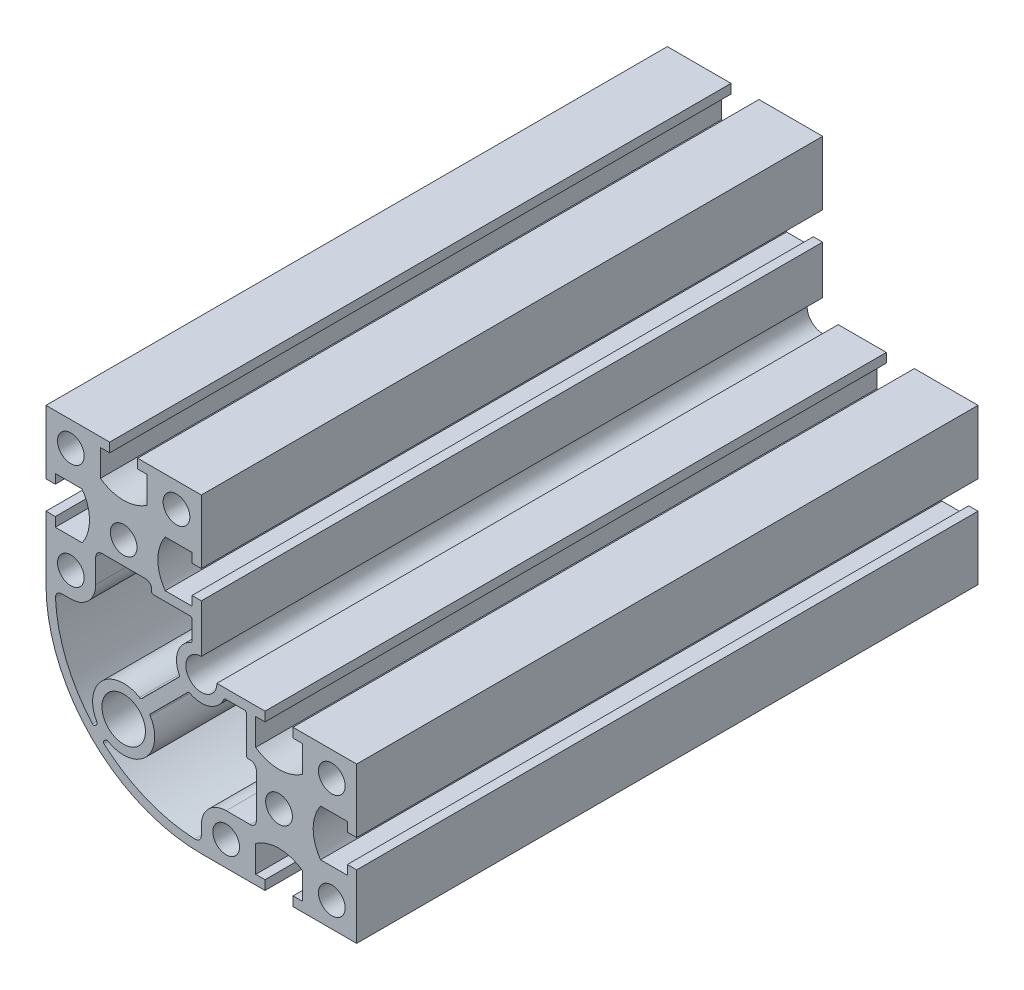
from build123d import *

# Parameters (mm, degrees)
SKETCH_1_R          = 2.15
EXTRUDE_1_DEPTH     = 50
SKETCH_2_R          = 3.5
CUT_EXTRUDE_1_DEPTH = 123.474487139


with BuildPart() as part:
    # Sketch 1 → Extrude 1 (new, symmetric)
    with BuildSketch(Plane.XY):
        with BuildLine():
            Line((0, 50), (0, 39.75))
            Line((0, 39.75), (1.5, 39.75))
            Line((1.5, 39.75), (1.5, 41.25))
            Line((1.5, 41.25), (5.809190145, 41.25))
            ThreePointArc((5.809190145, 41.25), (7, 37.5), (5.809190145, 33.75))
            Line((5.809190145, 33.75), (1.5, 33.75))
            Line((1.5, 33.75), (1.5, 35.25))
            Line((1.5, 35.25), (0, 35.25))
            Line((0, 35.25), (0, 25))
            ThreePointArc((0, 25), (7.32233047, 7.32233047), (25, 0))
            Line((25, 0), (35.25, 0))
            Line((35.25, 0), (35.25, 1.5))
            Line((35.25, 1.5), (33.75, 1.5))
            Line((33.75, 1.5), (33.75, 5.809190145))
            ThreePointArc((33.75, 5.809190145), (37.5, 7), (41.25, 5.809190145))
            Line((41.25, 5.809190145), (41.25, 1.5))
            Line((41.25, 1.5), (39.75, 1.5))
            Line((39.75, 1.5), (39.75, 0))
            Line((39.75, 0), (50, 0))
            Line((50, 0), (50, 10.25))
            Line((50, 10.25), (48.5, 10.25))
            Line((48.5, 10.25), (48.5, 8.75))
            Line((48.5, 8.75), (44.190809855, 8.75))
            ThreePointArc((44.190809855, 8.75), (43, 12.5), (44.190809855, 16.25))
            Line((44.190809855, 16.25), (48.5, 16.25))
            Line((48.5, 16.25), (48.5, 14.75))
            Line((48.5, 14.75), (50, 14.75))
            Line((50, 14.75), (50, 25))
            Line((50, 25), (39.75, 25))
            Line((39.75, 25), (39.75, 23.5))
            Line((39.75, 23.5), (41.25, 23.5))
            Line((41.25, 23.5), (41.25, 19.190809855))
            ThreePointArc((41.25, 19.190809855), (37.5, 18), (33.75, 19.190809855))
            Line((33.75, 19.190809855), (33.75, 23.5))
            Line((33.75, 23.5), (35.25, 23.5))
            Line((35.25, 23.5), (35.25, 25))
            Line((35.25, 25), (27.5, 25))
            ThreePointArc((27.5, 25), (23.232233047, 23.232233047), (25, 27.5))
            Line((25, 27.5), (25, 35.25))
            Line((25, 35.25), (23.5, 35.25))
            Line((23.5, 35.25), (23.5, 33.75))
            Line((23.5, 33.75), (19.190809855, 33.75))
            ThreePointArc((19.190809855, 33.75), (18, 37.5), (19.190809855, 41.25))
            Line((19.190809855, 41.25), (23.5, 41.25))
            Line((23.5, 41.25), (23.5, 39.75))
            Line((23.5, 39.75), (25, 39.75))
            Line((25, 39.75), (25, 50))
            Line((25, 50), (14.75, 50))
            Line((14.75, 50), (14.75, 48.5))
            Line((14.75, 48.5), (16.25, 48.5))
            Line((16.25, 48.5), (16.25, 44.190809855))
            ThreePointArc((16.25, 44.190809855), (12.5, 43), (8.75, 44.190809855))
            Line((8.75, 44.190809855), (8.75, 48.5))
            Line((8.75, 48.5), (10.25, 48.5))
            Line((10.25, 48.5), (10.25, 50))
            Line((10.25, 50), (0, 50))
        make_face()
        with Locations((46, 21)):
            Circle(SKETCH_1_R, mode=Mode.SUBTRACT)
        with Locations((46, 4)):
            Circle(SKETCH_1_R, mode=Mode.SUBTRACT)
        with Locations((29, 4)):
            Circle(SKETCH_1_R, mode=Mode.SUBTRACT)
        with Locations(Location((21, 46, 0), (0, 0, 180))):
            Circle(SKETCH_1_R, mode=Mode.SUBTRACT)
        with Locations(Location((4, 46, 0), (0, 0, 180))):
            Circle(SKETCH_1_R, mode=Mode.SUBTRACT)
        with Locations(Location((4, 29, 0), (0, 0, 180))):
            Circle(SKETCH_1_R, mode=Mode.SUBTRACT)
        with Locations((37.5, 12.5)):
            Circle(SKETCH_1_R, mode=Mode.SUBTRACT)
        with Locations((12.5, 37.5)):
            Circle(SKETCH_1_R, mode=Mode.SUBTRACT)
    extrude(amount=EXTRUDE_1_DEPTH, both=True)

    # Sketch 2 → Cut-Extrude 1 (cut, through all)
    with BuildSketch(Plane.XY.offset(50)):
        with Locations((12.5, 12.5)):
            Circle(SKETCH_2_R)
        with BuildLine():
            Line((8, 29), (8, 32.85))
            ThreePointArc((8, 32.85), (8.292893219, 33.557106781), (9, 33.85))
            Line((9, 33.85), (16, 33.85))
            ThreePointArc((16, 33.85), (16.707106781, 33.557106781), (17, 32.85))
            Line((17, 32.85), (17, 32.55))
            ThreePointArc((17, 32.55), (17.087867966, 32.337867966), (17.3, 32.25))
            Line((17.3, 32.25), (23.2, 32.25))
            ThreePointArc((23.2, 32.25), (23.412132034, 32.162132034), (23.5, 31.95))
            Line((23.5, 31.95), (23.5, 28.905124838))
            ThreePointArc((23.5, 28.905124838), (23.452660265, 28.743375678), (23.325581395, 28.632674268))
            ThreePointArc((23.325581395, 28.632674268), (21.216233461, 26.297347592), (21.448824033, 23.159035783))
            ThreePointArc((21.448824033, 23.159035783), (21.478955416, 22.975074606), (21.39461787, 22.808831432))
            Line((21.39461787, 22.808831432), (15.426073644, 16.840287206))
            ThreePointArc((15.426073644, 16.840287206), (15.251018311, 16.754719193), (15.060322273, 16.794735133))
            ThreePointArc((15.060322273, 16.794735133), (8.964466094, 16.035533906), (8.205264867, 9.939677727))
            ThreePointArc((8.205264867, 9.939677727), (8.245280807, 9.748981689), (8.159712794, 9.573926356))
            Line((8.159712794, 9.573926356), (7.913790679, 9.328004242))
            ThreePointArc((7.913790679, 9.328004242), (7.693250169, 9.240254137), (7.477973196, 9.340224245))
            ThreePointArc((7.477973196, 9.340224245), (3.237015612, 16.133066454), (1.52322135, 23.955555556))
            ThreePointArc((1.52322135, 23.955555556), (1.799583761, 24.691214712), (2.522233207, 25))
            Line((2.522233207, 25), (4, 25))
            ThreePointArc((4, 25), (6.828427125, 26.171572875), (8, 29))
        make_face()
        with BuildLine():
            Line((28.905124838, 23.5), (31.95, 23.5))
            ThreePointArc((31.95, 23.5), (32.162132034, 23.412132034), (32.25, 23.2))
            Line((32.25, 23.2), (32.25, 17.3))
            ThreePointArc((32.25, 17.3), (32.337867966, 17.087867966), (32.55, 17))
            Line((32.55, 17), (32.85, 17))
            ThreePointArc((32.85, 17), (33.557106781, 16.707106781), (33.85, 16))
            Line((33.85, 16), (33.85, 9))
            ThreePointArc((33.85, 9), (33.557106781, 8.292893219), (32.85, 8))
            Line((32.85, 8), (29, 8))
            ThreePointArc((29, 8), (26.171572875, 6.828427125), (25, 4))
            Line((25, 4), (25, 2.522233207))
            ThreePointArc((25, 2.522233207), (24.691214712, 1.799583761), (23.955555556, 1.52322135))
            ThreePointArc((23.955555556, 1.52322135), (16.133066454, 3.237015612), (9.340224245, 7.477973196))
            ThreePointArc((9.340224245, 7.477973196), (9.240254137, 7.693250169), (9.328004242, 7.913790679))
            Line((9.328004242, 7.913790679), (9.573926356, 8.159712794))
            ThreePointArc((9.573926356, 8.159712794), (9.748981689, 8.245280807), (9.939677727, 8.205264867))
            ThreePointArc((9.939677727, 8.205264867), (16.035533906, 8.964466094), (16.794735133, 15.060322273))
            ThreePointArc((16.794735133, 15.060322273), (16.754719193, 15.251018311), (16.840287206, 15.426073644))
            Line((16.840287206, 15.426073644), (22.808831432, 21.39461787))
            ThreePointArc((22.808831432, 21.39461787), (22.975074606, 21.478955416), (23.159035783, 21.448824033))
            ThreePointArc((23.159035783, 21.448824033), (26.297347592, 21.216233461), (28.632674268, 23.325581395))
            ThreePointArc((28.632674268, 23.325581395), (28.743375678, 23.452660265), (28.905124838, 23.5))
        make_face()
    extrude(amount=-CUT_EXTRUDE_1_DEPTH, mode=Mode.SUBTRACT)


solid = part.part
